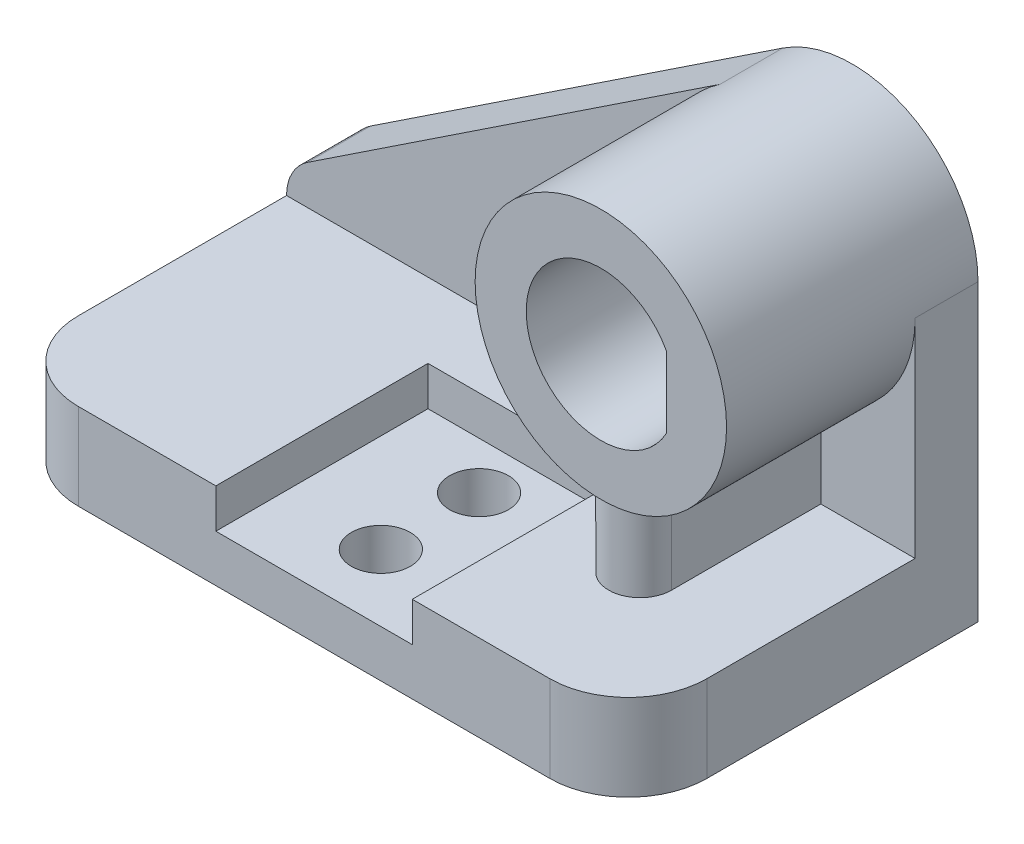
from build123d import *

# Parameters (mm, degrees)
SKETCH1_W            = 160
SKETCH1_H            = 89
BASE_PLATE_DEPTH     = 22
BASE_FILLET_R        = 20
VERTICAL_PLATE_DEPTH = 16
SKETCH3_R            = 32
CIRCULAR_BOSS_DEPTH  = 64
RIB_UNDER_REACH      = 203.856
RIB_UNDER_END_RADIUS = 32
D_HOLE_DEPTH         = 203.842303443
SKETCH6_W            = 50
SKETCH6_H            = 54
LOWER_CUTOUT_DEPTH   = 10
SKETCH6_4_R          = 7.5
LOWER_HOLES_DEPTH    = 202.856384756
SHELL1_T             = -4


with BuildPart() as part:
    # Sketch1 → Base_Plate (new body)
    with BuildSketch(Plane(origin=(0, 0, 0), x_dir=(1, 0, 0), z_dir=(0, 1, 0))):
        with Locations((80, 44.5)):
            Rectangle(SKETCH1_W, SKETCH1_H)
    extrude(amount=BASE_PLATE_DEPTH)

    # Base_Fillet
    base_fillet_edges = [part.edges().sort_by_distance(p)[0] for p in [
        (160, 11, 0),
        (0, 11, 0),
    ]]
    fillet(base_fillet_edges, radius=BASE_FILLET_R)

    # Sketch6 → Lower_Cutout (cut)
    with BuildSketch(Plane(origin=(0, 22, 0), x_dir=(1, 0, 0), z_dir=(0, 1, 0))):
        with Locations((80, 27)):
            Rectangle(SKETCH6_W, SKETCH6_H)
    extrude(amount=-LOWER_CUTOUT_DEPTH, mode=Mode.SUBTRACT)

    # Sketch6_4 → Lower_Holes (cut, through all)
    with BuildSketch(Plane(origin=(0, 22, 0), x_dir=(1, 0, 0), z_dir=(0, 1, 0))):
        with Locations(Location((80, 42, 0), (0, 0, 270))):
            Circle(SKETCH6_4_R)
        with Locations(Location((80, 17, 0), (0, 0, 270))):
            Circle(SKETCH6_4_R)
    extrude(amount=-LOWER_HOLES_DEPTH, mode=Mode.SUBTRACT)

    # Shell1
    shell1_openings = [part.faces().sort_by_distance(p)[0] for p in [
        (80, 0, -1.830874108),
    ]]
    offset(amount=SHELL1_T, openings=shell1_openings, kind=Kind.INTERSECTION)


with BuildPart() as body_2:
    # Sketch2 → Vertical_Plate (new body)
    with BuildSketch(Plane(origin=(0, 0, -89), x_dir=(-1, 0, 0), z_dir=(0, 0, -1))):
        with BuildLine():
            Line((-5.363158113, 31.997616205), (-110.301754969, 101.660309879))
            ThreePointArc((-110.301754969, 101.660309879), (-143.127064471, 103.198792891), (-160, 75))
            Line((-160, 75), (-160, 22))
            Line((-160, 22), (0, 22))
            ThreePointArc((0, 22), (-1.425452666, 27.672649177), (-5.363158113, 31.997616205))
        make_face()
    extrude(amount=-VERTICAL_PLATE_DEPTH)

    # Sketch3 → Circular_Boss (add)
    with BuildSketch(Plane(origin=(0, 0, -89), x_dir=(-1, 0, 0), z_dir=(0, 0, -1))):
        with Locations((-128, 75)):
            Circle(SKETCH3_R)
    extrude(amount=-CIRCULAR_BOSS_DEPTH)

    # Rib_Under: up to this cylinder (the profile starts outside it)
    rib_under_end = Plane(origin=(128, 75, -50.822409), z_dir=(0, 0, -1)) * Cylinder(RIB_UNDER_END_RADIUS, 472.712, mode=Mode.PRIVATE)
    # Sketch4 → Rib_Under (add, up to the surface)
    with BuildSketch(Plane(origin=(0, 22, 0), x_dir=(1, 0, 0), z_dir=(0, 1, 0)), mode=Mode.PRIVATE) as rib_under_sk1:
        with BuildLine():
            Line((120, 73), (120, 35))
            ThreePointArc((120, 35), (128, 27), (136, 35))
            Line((136, 35), (136, 73))
            Line((136, 73), (120, 73))
        make_face()
    rib_under_tool1 = extrude(rib_under_sk1.sketch, amount=RIB_UNDER_REACH, mode=Mode.PRIVATE) - rib_under_end
    add(rib_under_tool1.solids().sort_by_distance((128, 22, -50.822409))[0])

    # Sketch5 → D_Hole (cut, through all)
    with BuildSketch(Plane.XY.offset(-25)):
        with BuildLine():
            Line((144.733200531, 84), (144.733200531, 66))
            ThreePointArc((144.733200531, 66), (109, 75), (144.733200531, 84))
        make_face()
    extrude(amount=-D_HOLE_DEPTH, mode=Mode.SUBTRACT)

    # Combine1: union part
    add(part.part)


solid = body_2.part
